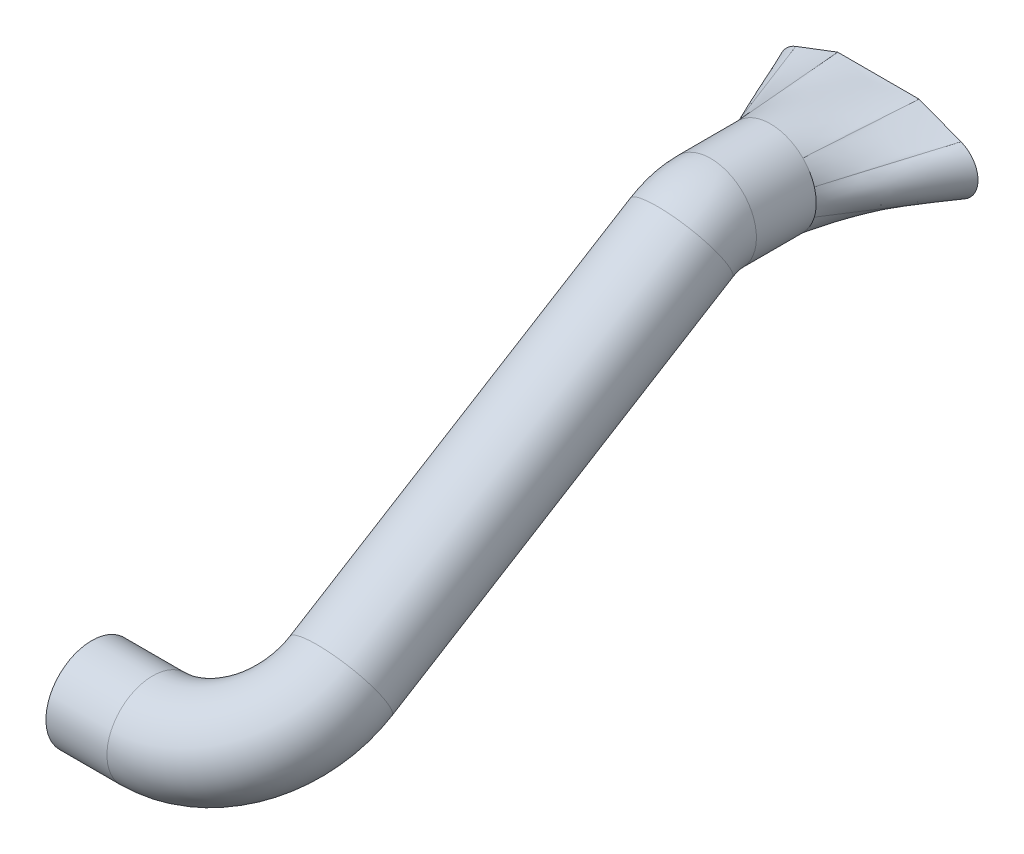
ISO-10303-21;
HEADER;
FILE_DESCRIPTION(('STEP AP214'),'2;1');
FILE_NAME('part.step','',(''),(''),'','','');
FILE_SCHEMA(('AUTOMOTIVE_DESIGN { 1 0 10303 214 1 1 1 1 }'));
ENDSEC;
DATA;
#1=APPLICATION_CONTEXT('core data for automotive mechanical design processes');
#2=APPLICATION_PROTOCOL_DEFINITION('international standard','automotive_design',2000,#1);
#3=PRODUCT_CONTEXT('',#1,'mechanical');
#4=PRODUCT('Part','Part','',(#3));
#5=PRODUCT_RELATED_PRODUCT_CATEGORY('part','',(#4));
#6=PRODUCT_DEFINITION_FORMATION('','',#4);
#7=PRODUCT_DEFINITION_CONTEXT('part definition',#1,'design');
#8=PRODUCT_DEFINITION('design','',#6,#7);
#9=PRODUCT_DEFINITION_SHAPE('','',#8);
#10=(LENGTH_UNIT() NAMED_UNIT(*) SI_UNIT(.MILLI.,.METRE.));
#11=(NAMED_UNIT(*) PLANE_ANGLE_UNIT() SI_UNIT($,.RADIAN.));
#12=(NAMED_UNIT(*) SI_UNIT($,.STERADIAN.) SOLID_ANGLE_UNIT());
#13=UNCERTAINTY_MEASURE_WITH_UNIT(LENGTH_MEASURE(1.E-05),#10,'distance_accuracy_value','');
#14=(GEOMETRIC_REPRESENTATION_CONTEXT(3) GLOBAL_UNCERTAINTY_ASSIGNED_CONTEXT((#13)) GLOBAL_UNIT_ASSIGNED_CONTEXT((#10,
#11,#12)) REPRESENTATION_CONTEXT('',''));
#15=CARTESIAN_POINT('',(0.,0.,0.));
#16=DIRECTION('',(0.,0.,1.));
#17=DIRECTION('',(1.,0.,0.));
#18=AXIS2_PLACEMENT_3D('',#15,#16,#17);
#19=CARTESIAN_POINT('',(-42.,34.,0.));
#20=DIRECTION('',(0.,0.,1.));
#21=DIRECTION('',(1.,0.,0.));
#22=AXIS2_PLACEMENT_3D('',#19,#20,#21);
#23=PLANE('',#22);
#24=CARTESIAN_POINT('',(-42.,34.,0.));
#25=DIRECTION('',(0.,0.,1.));
#26=DIRECTION('',(1.,0.,0.));
#27=AXIS2_PLACEMENT_3D('',#24,#25,#26);
#28=CIRCLE('',#27,13.);
#29=CARTESIAN_POINT('',(-46.6245425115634,46.1496340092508,0.));
#30=VERTEX_POINT('',#29);
#31=CARTESIAN_POINT('',(-46.6245425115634,21.8503659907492,0.));
#32=VERTEX_POINT('',#31);
#33=EDGE_CURVE('E143',#30,#32,#28,.T.);
#34=ORIENTED_EDGE('',*,*,#33,.F.);
#35=DIRECTION('',(-0.934587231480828,-0.355734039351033,0.));
#36=VECTOR('',#35,1.);
#37=CARTESIAN_POINT('',(-26.,54.,0.));
#38=LINE('',#37,#36);
#39=CARTESIAN_POINT('',(-26.,54.,0.));
#40=VERTEX_POINT('',#39);
#41=EDGE_CURVE('E11',#40,#30,#38,.T.);
#42=ORIENTED_EDGE('',*,*,#41,.F.);
#43=DIRECTION('',(-1.,0.,0.));
#44=VECTOR('',#43,1.);
#45=CARTESIAN_POINT('',(14.,54.,0.));
#46=LINE('',#45,#44);
#47=CARTESIAN_POINT('',(14.,54.,0.));
#48=VERTEX_POINT('',#47);
#49=EDGE_CURVE('E40',#48,#40,#46,.T.);
#50=ORIENTED_EDGE('',*,*,#49,.F.);
#51=DIRECTION('',(-0.934587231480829,0.355734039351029,0.));
#52=VECTOR('',#51,1.);
#53=CARTESIAN_POINT('',(34.6245425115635,46.1496340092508,0.));
#54=LINE('',#53,#52);
#55=CARTESIAN_POINT('',(34.6245425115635,46.1496340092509,0.));
#56=VERTEX_POINT('',#55);
#57=EDGE_CURVE('E152',#56,#48,#54,.T.);
#58=ORIENTED_EDGE('',*,*,#57,.F.);
#59=CARTESIAN_POINT('',(30.,34.,0.));
#60=DIRECTION('',(0.,0.,1.));
#61=DIRECTION('',(1.,0.,0.));
#62=AXIS2_PLACEMENT_3D('',#59,#60,#61);
#63=CIRCLE('',#62,13.0000000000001);
#64=CARTESIAN_POINT('',(34.6245425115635,21.8503659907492,0.));
#65=VERTEX_POINT('',#64);
#66=EDGE_CURVE('E149',#65,#56,#63,.T.);
#67=ORIENTED_EDGE('',*,*,#66,.F.);
#68=DIRECTION('',(0.934587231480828,0.35573403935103,0.));
#69=VECTOR('',#68,1.);
#70=CARTESIAN_POINT('',(14.,14.,0.));
#71=LINE('',#70,#69);
#72=CARTESIAN_POINT('',(14.,14.,0.));
#73=VERTEX_POINT('',#72);
#74=EDGE_CURVE('E146',#73,#65,#71,.T.);
#75=ORIENTED_EDGE('',*,*,#74,.F.);
#76=DIRECTION('',(1.,0.,0.));
#77=VECTOR('',#76,1.);
#78=CARTESIAN_POINT('',(-26.,14.,0.));
#79=LINE('',#78,#77);
#80=CARTESIAN_POINT('',(-26.,14.,0.));
#81=VERTEX_POINT('',#80);
#82=EDGE_CURVE('E142',#81,#73,#79,.T.);
#83=ORIENTED_EDGE('',*,*,#82,.F.);
#84=DIRECTION('',(0.934587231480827,-0.355734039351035,0.));
#85=VECTOR('',#84,1.);
#86=CARTESIAN_POINT('',(-46.6245425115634,21.8503659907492,0.));
#87=LINE('',#86,#85);
#88=EDGE_CURVE('E139',#32,#81,#87,.T.);
#89=ORIENTED_EDGE('',*,*,#88,.F.);
#90=EDGE_LOOP('',(#34,#42,#50,#58,#67,#75,#83,#89));
#91=FACE_BOUND('',#90,.T.);
#92=ADVANCED_FACE('F32',(#91),#23,.F.);
#93=CARTESIAN_POINT('',(-46.6245425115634,21.8503659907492,0.));
#94=CARTESIAN_POINT('',(-45.7337784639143,22.1921536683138,2.77777777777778));
#95=CARTESIAN_POINT('',(-43.952250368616,22.8757290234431,8.33333333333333));
#96=CARTESIAN_POINT('',(-41.2799582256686,23.9010920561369,16.6666666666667));
#97=CARTESIAN_POINT('',(-38.6076660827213,24.9264550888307,25.));
#98=CARTESIAN_POINT('',(-35.7126829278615,26.0372650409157,34.0277777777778));
#99=CARTESIAN_POINT('',(-33.2909181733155,26.9665002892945,41.5798611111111));
#100=CARTESIAN_POINT('',(-31.5093900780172,27.6500756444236,47.1354166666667));
#101=CARTESIAN_POINT('',(-30.8413170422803,27.9064164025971,49.21875));
#102=CARTESIAN_POINT('',(-30.590789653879,28.0025441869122,50.));
#103=CARTESIAN_POINT('',(-39.749695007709,19.2335773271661,0.));
#104=CARTESIAN_POINT('',(-39.3482825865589,19.4363849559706,2.21586738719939));
#105=CARTESIAN_POINT('',(-38.5430084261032,19.8432376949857,6.66112282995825));
#106=CARTESIAN_POINT('',(-37.0015477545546,20.6938765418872,14.5840386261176));
#107=CARTESIAN_POINT('',(-35.315250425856,21.5865639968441,22.9753008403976));
#108=CARTESIAN_POINT('',(-33.546037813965,22.7058639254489,32.2383831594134));
#109=CARTESIAN_POINT('',(-31.7453902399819,23.5628470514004,40.2747419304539));
#110=CARTESIAN_POINT('',(-30.2747850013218,24.1325842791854,46.6256772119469));
#111=CARTESIAN_POINT('',(-29.7233448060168,24.3346401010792,49.0795290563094));
#112=CARTESIAN_POINT('',(-29.5164925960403,24.4104338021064,50.));
#113=CARTESIAN_POINT('',(-32.8748475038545,16.616788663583,0.));
#114=CARTESIAN_POINT('',(-32.5877291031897,16.8655343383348,2.7191394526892));
#115=CARTESIAN_POINT('',(-32.0117403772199,17.3645434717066,8.17400986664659));
#116=CARTESIAN_POINT('',(-31.1387316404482,18.120876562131,16.4417924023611));
#117=CARTESIAN_POINT('',(-30.2599569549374,18.8822049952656,24.7641810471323));
#118=CARTESIAN_POINT('',(-29.3053603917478,19.7092218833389,33.8046367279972));
#119=CARTESIAN_POINT('',(-28.501571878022,20.4055858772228,41.4168728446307));
#120=CARTESIAN_POINT('',(-27.9041914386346,20.9231277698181,47.0743323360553));
#121=CARTESIAN_POINT('',(-27.6795363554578,21.1177582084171,49.2019162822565));
#122=CARTESIAN_POINT('',(-27.5952653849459,21.1907665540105,50.));
#123=CARTESIAN_POINT('',(-26.,14.,0.));
#124=CARTESIAN_POINT('',(-25.9413388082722,14.2521999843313,2.77777777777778));
#125=CARTESIAN_POINT('',(-25.8240164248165,14.7565999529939,8.33333333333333));
#126=CARTESIAN_POINT('',(-25.648032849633,15.5131999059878,16.6666666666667));
#127=CARTESIAN_POINT('',(-25.4720492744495,16.2697998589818,25.));
#128=CARTESIAN_POINT('',(-25.281400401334,17.0894498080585,34.0277777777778));
#129=CARTESIAN_POINT('',(-25.121915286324,17.7751185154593,41.5798611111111));
#130=CARTESIAN_POINT('',(-25.0045929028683,18.2795184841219,47.1354166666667));
#131=CARTESIAN_POINT('',(-24.9605970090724,18.4686684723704,49.21875));
#132=CARTESIAN_POINT('',(-24.944098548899,18.5395997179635,50.));
#133=(BOUNDED_SURFACE() B_SPLINE_SURFACE(3,3,((#93,#94,#95,#96,#97,#98,#99,#100,#101,#102),
(#103,#104,#105,#106,#107,#108,#109,#110,#111,#112),(#113,#114,#115,#116,#117,#118,#119,#120,
#121,#122),(#123,#124,#125,#126,#127,#128,#129,#130,#131,#132)),.UNSPECIFIED.,.F.,.F.,
.F.) B_SPLINE_SURFACE_WITH_KNOTS((4,4),(4,1,1,1,1,1,1,4),(0.666666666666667,1.),(0.,
0.166666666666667,0.333333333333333,0.5,0.666666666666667,0.875,0.953125,1.),
.UNSPECIFIED.) GEOMETRIC_REPRESENTATION_ITEM() RATIONAL_B_SPLINE_SURFACE(((1.,1.,1.,1.,1.,1.,1.,
1.,1.,1.),(1.,1.,0.997970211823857,0.992895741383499,0.989851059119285,0.986552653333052,
0.981723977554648,0.979916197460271,0.979702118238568,0.979702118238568),(1.,1.,
0.997970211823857,0.992895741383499,0.989851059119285,0.986552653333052,0.981723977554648,
0.979916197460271,0.979702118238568,0.979702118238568),(1.,1.,1.,1.,1.,1.,1.,1.,1.,1.))) REPRESENTATION_ITEM('') SURFACE());
#134=DIRECTION('',(0.0210268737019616,0.0904000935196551,0.995683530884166));
#135=VECTOR('',#134,1.);
#136=CARTESIAN_POINT('',(-25.4720492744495,16.2697998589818,25.));
#137=LINE('',#136,#135);
#138=CARTESIAN_POINT('',(-24.944098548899,18.5395997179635,50.));
#139=VERTEX_POINT('',#138);
#140=EDGE_CURVE('E156',#81,#139,#137,.T.);
#141=CARTESIAN_POINT('',(-24.944098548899,18.5395997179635,50.));
#142=CARTESIAN_POINT('',(-27.5952653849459,21.1907665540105,50.));
#143=CARTESIAN_POINT('',(-29.5164925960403,24.4104338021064,50.));
#144=CARTESIAN_POINT('',(-30.590789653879,28.0025441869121,50.));
#145=(BOUNDED_CURVE() B_SPLINE_CURVE(3,(#141,#142,#143,#144),.UNSPECIFIED.,.F.,
.F.) B_SPLINE_CURVE_WITH_KNOTS((4,4),(0.666666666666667,1.),
.UNSPECIFIED.) CURVE() GEOMETRIC_REPRESENTATION_ITEM() RATIONAL_B_SPLINE_CURVE((1.,
0.979702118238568,0.979702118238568,1.)) REPRESENTATION_ITEM(''));
#146=CARTESIAN_POINT('',(-30.5909142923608,28.0025069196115,50.));
#147=VERTEX_POINT('',#146);
#148=EDGE_CURVE('E131',#147,#139,#145,.F.);
#149=DIRECTION('',(0.303284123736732,0.116370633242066,0.945767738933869));
#150=VECTOR('',#149,1.);
#151=CARTESIAN_POINT('',(-38.6076660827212,24.9264550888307,25.));
#152=LINE('',#151,#150);
#153=EDGE_CURVE('E161',#32,#147,#152,.T.);
#154=ORIENTED_EDGE('',*,*,#88,.T.);
#155=ORIENTED_EDGE('',*,*,#140,.T.);
#156=ORIENTED_EDGE('',*,*,#148,.F.);
#157=ORIENTED_EDGE('',*,*,#153,.F.);
#158=EDGE_LOOP('',(#154,#155,#156,#157));
#159=FACE_BOUND('',#158,.T.);
#160=ADVANCED_FACE('F182',(#159),#133,.T.);
#161=CARTESIAN_POINT('',(-46.6245425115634,46.1496340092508,0.));
#162=CARTESIAN_POINT('',(-45.7337784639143,45.8577910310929,2.77777777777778));
#163=CARTESIAN_POINT('',(-43.952250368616,45.2741050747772,8.33333333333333));
#164=CARTESIAN_POINT('',(-41.2799582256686,44.3985761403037,16.6666666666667));
#165=CARTESIAN_POINT('',(-38.6076660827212,43.5230472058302,25.));
#166=CARTESIAN_POINT('',(-35.7126829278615,42.5745575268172,34.0277777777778));
#167=CARTESIAN_POINT('',(-33.2909181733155,41.7811094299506,41.5798611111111));
#168=CARTESIAN_POINT('',(-31.5093900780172,41.1974234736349,47.1354166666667));
#169=CARTESIAN_POINT('',(-30.8413170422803,40.9785412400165,49.21875));
#170=CARTESIAN_POINT('',(-30.590789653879,40.8964604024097,50.));
#171=CARTESIAN_POINT('',(-59.8937269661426,41.0989544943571,0.));
#172=CARTESIAN_POINT('',(-57.7301654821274,40.6963656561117,3.86768630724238));
#173=CARTESIAN_POINT('',(-53.829867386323,39.9706102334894,10.8400463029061));
#174=CARTESIAN_POINT('',(-48.9881607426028,38.8512754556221,20.0323374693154));
#175=CARTESIAN_POINT('',(-44.4559126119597,37.7700409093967,28.3973112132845));
#176=CARTESIAN_POINT('',(-39.7148223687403,36.7441283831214,36.9089941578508));
#177=CARTESIAN_POINT('',(-35.7149723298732,36.5236869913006,43.4053006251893));
#178=CARTESIAN_POINT('',(-33.1209188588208,36.5940706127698,47.7654531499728));
#179=CARTESIAN_POINT('',(-32.2007188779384,36.6423058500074,49.393233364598));
#180=CARTESIAN_POINT('',(-31.8577077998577,36.6602858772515,50.));
#181=CARTESIAN_POINT('',(-59.8937269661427,26.9010455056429,0.));
#182=CARTESIAN_POINT('',(-57.7386270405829,27.3766404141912,3.86690430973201));
#183=CARTESIAN_POINT('',(-53.8535827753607,28.2340054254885,10.8378545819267));
#184=CARTESIAN_POINT('',(-49.0120370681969,29.5231221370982,20.0329957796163));
#185=CARTESIAN_POINT('',(-44.4769066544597,30.7559469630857,28.3966763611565));
#186=CARTESIAN_POINT('',(-39.7322406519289,31.9374402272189,36.907422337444));
#187=CARTESIAN_POINT('',(-35.7243897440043,32.2730348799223,43.4030466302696));
#188=CARTESIAN_POINT('',(-33.123893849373,32.2716443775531,47.7633406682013));
#189=CARTESIAN_POINT('',(-32.2015267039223,32.2476593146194,49.392659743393));
#190=CARTESIAN_POINT('',(-31.8577077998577,32.2387187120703,50.));
#191=CARTESIAN_POINT('',(-46.6245425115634,21.8503659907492,0.));
#192=CARTESIAN_POINT('',(-45.7337784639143,22.1921536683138,2.77777777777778));
#193=CARTESIAN_POINT('',(-43.952250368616,22.8757290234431,8.33333333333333));
#194=CARTESIAN_POINT('',(-41.2799582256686,23.9010920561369,16.6666666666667));
#195=CARTESIAN_POINT('',(-38.6076660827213,24.9264550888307,25.));
#196=CARTESIAN_POINT('',(-35.7126829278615,26.0372650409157,34.0277777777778));
#197=CARTESIAN_POINT('',(-33.2909181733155,26.9665002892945,41.5798611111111));
#198=CARTESIAN_POINT('',(-31.5093900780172,27.6500756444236,47.1354166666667));
#199=CARTESIAN_POINT('',(-30.8413170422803,27.9064164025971,49.21875));
#200=CARTESIAN_POINT('',(-30.590789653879,28.0025441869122,50.));
#201=(BOUNDED_SURFACE() B_SPLINE_SURFACE(3,3,((#161,#162,#163,#164,#165,#166,#167,#168,#169,
#170),(#171,#172,#173,#174,#175,#176,#177,#178,#179,#180),(#181,#182,#183,#184,#185,#186,#187,
#188,#189,#190),(#191,#192,#193,#194,#195,#196,#197,#198,#199,#200)),.UNSPECIFIED.,.F.,.F.,
.F.) B_SPLINE_SURFACE_WITH_KNOTS((4,4),(4,1,1,1,1,1,1,4),(0.333333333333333,0.666666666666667),
(0.,0.166666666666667,0.333333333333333,0.5,0.666666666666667,0.875,0.953125,1.),
.UNSPECIFIED.) GEOMETRIC_REPRESENTATION_ITEM() RATIONAL_B_SPLINE_SURFACE(((1.,1.,1.,1.,1.,1.,1.,
1.,1.,1.),(0.570489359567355,0.570489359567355,0.610645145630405,0.711034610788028,
0.771268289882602,0.836521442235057,0.932048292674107,0.967812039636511,0.972047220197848,
0.972047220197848),(0.570489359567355,0.570489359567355,0.610645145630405,0.711034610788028,
0.771268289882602,0.836521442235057,0.932048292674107,0.967812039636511,0.972047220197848,
0.972047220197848),(1.,1.,1.,1.,1.,1.,1.,1.,1.,1.))) REPRESENTATION_ITEM('') SURFACE());
#202=CARTESIAN_POINT('',(-30.590789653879,28.0025441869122,50.));
#203=CARTESIAN_POINT('',(-31.8577077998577,32.2387187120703,50.));
#204=CARTESIAN_POINT('',(-31.8577077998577,36.6602858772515,50.));
#205=CARTESIAN_POINT('',(-30.590789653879,40.8964604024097,50.));
#206=(BOUNDED_CURVE() B_SPLINE_CURVE(3,(#202,#203,#204,#205),.UNSPECIFIED.,.F.,
.F.) B_SPLINE_CURVE_WITH_KNOTS((4,4),(0.333333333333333,0.666666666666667),
.UNSPECIFIED.) CURVE() GEOMETRIC_REPRESENTATION_ITEM() RATIONAL_B_SPLINE_CURVE((1.,
0.972047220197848,0.972047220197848,1.)) REPRESENTATION_ITEM(''));
#207=CARTESIAN_POINT('',(-30.5909153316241,40.8964979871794,50.));
#208=VERTEX_POINT('',#207);
#209=EDGE_CURVE('E114',#208,#147,#206,.F.);
#210=DIRECTION('',(0.30384197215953,-0.09954841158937,0.947507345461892));
#211=VECTOR('',#210,1.);
#212=CARTESIAN_POINT('',(-38.6076660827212,43.5230472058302,25.));
#213=LINE('',#212,#211);
#214=EDGE_CURVE('E48',#30,#208,#213,.T.);
#215=ORIENTED_EDGE('',*,*,#33,.T.);
#216=ORIENTED_EDGE('',*,*,#153,.T.);
#217=ORIENTED_EDGE('',*,*,#209,.F.);
#218=ORIENTED_EDGE('',*,*,#214,.F.);
#219=EDGE_LOOP('',(#215,#216,#217,#218));
#220=FACE_BOUND('',#219,.T.);
#221=ADVANCED_FACE('F171',(#220),#201,.T.);
#222=CARTESIAN_POINT('',(-26.,54.,0.));
#223=CARTESIAN_POINT('',(-25.9413388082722,53.7977447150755,2.77777777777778));
#224=CARTESIAN_POINT('',(-25.8240164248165,53.3932341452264,8.33333333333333));
#225=CARTESIAN_POINT('',(-25.648032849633,52.7864682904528,16.6666666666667));
#226=CARTESIAN_POINT('',(-25.4720492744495,52.1797024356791,25.));
#227=CARTESIAN_POINT('',(-25.281400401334,51.5223727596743,34.0277777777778));
#228=CARTESIAN_POINT('',(-25.121915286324,50.9724912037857,41.5798611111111));
#229=CARTESIAN_POINT('',(-25.0045929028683,50.5679806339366,47.1354166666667));
#230=CARTESIAN_POINT('',(-24.9605970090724,50.4162891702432,49.21875));
#231=CARTESIAN_POINT('',(-24.944098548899,50.3594048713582,50.));
#232=CARTESIAN_POINT('',(-32.8748475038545,51.383211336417,0.));
#233=CARTESIAN_POINT('',(-32.5877291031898,51.1833560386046,2.7191394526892));
#234=CARTESIAN_POINT('',(-32.0117403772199,50.782425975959,8.1740098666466));
#235=CARTESIAN_POINT('',(-31.1387316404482,50.174748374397,16.4417924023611));
#236=CARTESIAN_POINT('',(-30.2599569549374,49.5630572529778,24.7641810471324));
#237=CARTESIAN_POINT('',(-29.3053603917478,48.8985885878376,33.8046367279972));
#238=CARTESIAN_POINT('',(-28.501571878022,48.3390932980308,41.4168728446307));
#239=CARTESIAN_POINT('',(-27.9041914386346,47.9232730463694,47.0743323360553));
#240=CARTESIAN_POINT('',(-27.6795363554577,47.7668967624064,49.2019162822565));
#241=CARTESIAN_POINT('',(-27.5952653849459,47.7082380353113,50.));
#242=CARTESIAN_POINT('',(-39.749695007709,48.7664226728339,0.));
#243=CARTESIAN_POINT('',(-39.3447797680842,48.6055266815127,2.21379415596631));
#244=CARTESIAN_POINT('',(-38.532478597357,48.2827529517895,6.65489048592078));
#245=CARTESIAN_POINT('',(-36.9901225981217,47.5786385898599,14.5719440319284));
#246=CARTESIAN_POINT('',(-35.3045738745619,46.83997877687,22.9612422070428));
#247=CARTESIAN_POINT('',(-33.5385388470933,45.8895900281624,32.2229512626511));
#248=CARTESIAN_POINT('',(-31.7411344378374,45.1750742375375,40.2649876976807));
#249=CARTESIAN_POINT('',(-30.2734462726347,44.711612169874,46.6231327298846));
#250=CARTESIAN_POINT('',(-29.7229796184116,44.5494135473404,49.078834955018));
#251=CARTESIAN_POINT('',(-29.5164925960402,44.4885707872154,50.));
#252=CARTESIAN_POINT('',(-46.6245425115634,46.1496340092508,0.));
#253=CARTESIAN_POINT('',(-45.7337784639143,45.8577910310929,2.77777777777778));
#254=CARTESIAN_POINT('',(-43.952250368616,45.2741050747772,8.33333333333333));
#255=CARTESIAN_POINT('',(-41.2799582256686,44.3985761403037,16.6666666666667));
#256=CARTESIAN_POINT('',(-38.6076660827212,43.5230472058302,25.));
#257=CARTESIAN_POINT('',(-35.7126829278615,42.5745575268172,34.0277777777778));
#258=CARTESIAN_POINT('',(-33.2909181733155,41.7811094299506,41.5798611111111));
#259=CARTESIAN_POINT('',(-31.5093900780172,41.1974234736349,47.1354166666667));
#260=CARTESIAN_POINT('',(-30.8413170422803,40.9785412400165,49.21875));
#261=CARTESIAN_POINT('',(-30.590789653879,40.8964604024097,50.));
#262=(BOUNDED_SURFACE() B_SPLINE_SURFACE(3,3,((#222,#223,#224,#225,#226,#227,#228,#229,#230,
#231),(#232,#233,#234,#235,#236,#237,#238,#239,#240,#241),(#242,#243,#244,#245,#246,#247,#248,
#249,#250,#251),(#252,#253,#254,#255,#256,#257,#258,#259,#260,#261)),.UNSPECIFIED.,.F.,.F.,
.F.) B_SPLINE_SURFACE_WITH_KNOTS((4,4),(4,1,1,1,1,1,1,4),(0.,0.333333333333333),(0.,
0.166666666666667,0.333333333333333,0.5,0.666666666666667,0.875,0.953125,1.),
.UNSPECIFIED.) GEOMETRIC_REPRESENTATION_ITEM() RATIONAL_B_SPLINE_SURFACE(((1.,1.,1.,1.,1.,1.,1.,
1.,1.,1.),(1.,1.,0.997970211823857,0.992895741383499,0.989851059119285,0.986552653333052,
0.981723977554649,0.979916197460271,0.979702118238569,0.979702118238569),(1.,1.,
0.997970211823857,0.992895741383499,0.989851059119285,0.986552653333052,0.981723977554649,
0.979916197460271,0.979702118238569,0.979702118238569),(1.,1.,1.,1.,1.,1.,1.,1.,1.,1.))) REPRESENTATION_ITEM('') SURFACE());
#263=CARTESIAN_POINT('',(-9.03419597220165,34.4495022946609,50.));
#264=DIRECTION('',(0.,0.,-1.));
#265=DIRECTION('',(-1.,0.,0.));
#266=AXIS2_PLACEMENT_3D('',#263,#264,#265);
#267=CIRCLE('',#266,22.5);
#268=CARTESIAN_POINT('',(-24.944098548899,50.3594048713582,50.));
#269=VERTEX_POINT('',#268);
#270=EDGE_CURVE('E109',#269,#208,#267,.F.);
#271=DIRECTION('',(0.0210576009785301,-0.072603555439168,0.997138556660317));
#272=VECTOR('',#271,1.);
#273=CARTESIAN_POINT('',(-25.4720492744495,52.1797024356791,25.));
#274=LINE('',#273,#272);
#275=EDGE_CURVE('E97',#40,#269,#274,.T.);
#276=ORIENTED_EDGE('',*,*,#41,.T.);
#277=ORIENTED_EDGE('',*,*,#214,.T.);
#278=ORIENTED_EDGE('',*,*,#270,.F.);
#279=ORIENTED_EDGE('',*,*,#275,.F.);
#280=EDGE_LOOP('',(#276,#277,#278,#279));
#281=FACE_BOUND('',#280,.T.);
#282=ADVANCED_FACE('F110',(#281),#262,.T.);
#283=CARTESIAN_POINT('',(-26.,14.,0.));
#284=CARTESIAN_POINT('',(-24.944098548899,18.5395997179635,50.));
#285=CARTESIAN_POINT('',(-12.6666666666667,14.,0.));
#286=CARTESIAN_POINT('',(-15.6242933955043,9.21979456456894,50.));
#287=CARTESIAN_POINT('',(0.666666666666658,14.,0.));
#288=CARTESIAN_POINT('',(-2.44409854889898,9.21979456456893,50.));
#289=CARTESIAN_POINT('',(14.,14.,0.));
#290=CARTESIAN_POINT('',(6.87570660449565,18.5395997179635,50.));
#291=(BOUNDED_SURFACE() B_SPLINE_SURFACE(3,1,((#283,#284),(#285,#286),(#287,#288),(#289,#290)),
.UNSPECIFIED.,.F.,.F.,.F.) B_SPLINE_SURFACE_WITH_KNOTS((4,4),(2,2),(0.,1.),(0.,1.),
.UNSPECIFIED.) GEOMETRIC_REPRESENTATION_ITEM() RATIONAL_B_SPLINE_SURFACE(((1.,1.),(1.,
0.804737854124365),(1.,0.804737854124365),(1.,1.))) REPRESENTATION_ITEM('') SURFACE());
#292=DIRECTION('',(-0.140494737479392,0.0895232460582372,0.986025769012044));
#293=VECTOR('',#292,1.);
#294=CARTESIAN_POINT('',(10.4378533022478,16.2697998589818,25.));
#295=LINE('',#294,#293);
#296=CARTESIAN_POINT('',(6.87570660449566,18.5395997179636,50.));
#297=VERTEX_POINT('',#296);
#298=EDGE_CURVE('E106',#73,#297,#295,.T.);
#299=CARTESIAN_POINT('',(6.87570660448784,18.5395997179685,50.0000000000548));
#300=CARTESIAN_POINT('',(6.63920978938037,18.3030952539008,50.0000000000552));
#301=CARTESIAN_POINT('',(6.39743206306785,18.0718715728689,50.0000000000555));
#302=CARTESIAN_POINT('',(5.89946348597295,17.6164517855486,50.0000000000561));
#303=CARTESIAN_POINT('',(5.64309375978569,17.3924512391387,50.0000000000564));
#304=CARTESIAN_POINT('',(5.11608629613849,16.9526660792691,50.0000000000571));
#305=CARTESIAN_POINT('',(4.84528168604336,16.7370814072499,50.0000000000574));
#306=CARTESIAN_POINT('',(4.28967064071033,16.3153321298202,50.000000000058));
#307=CARTESIAN_POINT('',(4.00471075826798,16.1093696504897,50.0000000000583));
#308=CARTESIAN_POINT('',(3.42117603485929,15.7080791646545,50.0000000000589));
#309=CARTESIAN_POINT('',(3.12246226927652,15.5129531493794,50.0000000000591));
#310=CARTESIAN_POINT('',(2.51193413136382,15.13454364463,50.0000000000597));
#311=CARTESIAN_POINT('',(2.19999622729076,14.951459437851,50.0000000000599));
#312=CARTESIAN_POINT('',(1.56366405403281,14.5983200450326,50.0000000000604));
#313=CARTESIAN_POINT('',(1.23916220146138,14.4284586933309,50.0000000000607));
#314=CARTESIAN_POINT('',(0.578477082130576,14.1029130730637,50.0000000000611));
#315=CARTESIAN_POINT('',(0.242202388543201,13.9474143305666,50.0000000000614));
#316=CARTESIAN_POINT('',(-0.441124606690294,13.6516863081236,50.0000000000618));
#317=CARTESIAN_POINT('',(-0.788252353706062,13.5116313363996,50.000000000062));
#318=CARTESIAN_POINT('',(-1.49225725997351,13.2478100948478,50.0000000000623));
#319=CARTESIAN_POINT('',(-1.84919446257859,13.1242040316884,50.0000000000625));
#320=CARTESIAN_POINT('',(-2.57167292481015,12.8942095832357,50.0000000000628));
#321=CARTESIAN_POINT('',(-2.93725981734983,12.7879645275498,50.000000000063));
#322=CARTESIAN_POINT('',(-3.67578511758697,12.5935144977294,50.0000000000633));
#323=CARTESIAN_POINT('',(-4.04875614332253,12.5054333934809,50.0000000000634));
#324=CARTESIAN_POINT('',(-4.80070259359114,12.348012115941,50.0000000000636));
#325=CARTESIAN_POINT('',(-5.17969939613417,12.2787740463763,50.0000000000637));
#326=CARTESIAN_POINT('',(-5.94227074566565,12.159604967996,50.0000000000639));
#327=CARTESIAN_POINT('',(-6.32585754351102,12.1097523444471,50.000000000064));
#328=CARTESIAN_POINT('',(-7.09611983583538,12.0297746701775,50.0000000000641));
#329=CARTESIAN_POINT('',(-7.48280084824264,11.9997027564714,50.0000000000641));
#330=CARTESIAN_POINT('',(-8.25771897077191,11.9595531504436,50.0000000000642));
#331=CARTESIAN_POINT('',(-8.64595747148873,11.9495022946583,50.0000000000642));
#332=CARTESIAN_POINT('',(-9.42243447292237,11.9495022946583,50.0000000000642));
#333=CARTESIAN_POINT('',(-9.81067297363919,11.9595531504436,50.0000000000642));
#334=CARTESIAN_POINT('',(-10.5855910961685,11.9997027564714,50.0000000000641));
#335=CARTESIAN_POINT('',(-10.9722721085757,12.0297746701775,50.0000000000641));
#336=CARTESIAN_POINT('',(-11.7425344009,12.1097523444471,50.000000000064));
#337=CARTESIAN_POINT('',(-12.1261211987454,12.159604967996,50.0000000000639));
#338=CARTESIAN_POINT('',(-12.8886925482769,12.2787740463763,50.0000000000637));
#339=CARTESIAN_POINT('',(-13.2676893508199,12.348012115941,50.0000000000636));
#340=CARTESIAN_POINT('',(-14.0196358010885,12.5054333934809,50.0000000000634));
#341=CARTESIAN_POINT('',(-14.392606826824,12.5935144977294,50.0000000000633));
#342=CARTESIAN_POINT('',(-15.1311321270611,12.7879645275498,50.000000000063));
#343=CARTESIAN_POINT('',(-15.4967190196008,12.8942095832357,50.0000000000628));
#344=CARTESIAN_POINT('',(-16.2191974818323,13.1242040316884,50.0000000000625));
#345=CARTESIAN_POINT('',(-16.5761346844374,13.2478100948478,50.0000000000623));
#346=CARTESIAN_POINT('',(-17.2801395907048,13.5116313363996,50.000000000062));
#347=CARTESIAN_POINT('',(-17.6272673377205,13.6516863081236,50.0000000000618));
#348=CARTESIAN_POINT('',(-18.310594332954,13.9474143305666,50.0000000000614));
#349=CARTESIAN_POINT('',(-18.6468690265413,14.1029130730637,50.0000000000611));
#350=CARTESIAN_POINT('',(-19.307554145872,14.4284586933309,50.0000000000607));
#351=CARTESIAN_POINT('',(-19.6320559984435,14.5983200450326,50.0000000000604));
#352=CARTESIAN_POINT('',(-20.2683881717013,14.951459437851,50.0000000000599));
#353=CARTESIAN_POINT('',(-20.5803260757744,15.13454364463,50.0000000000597));
#354=CARTESIAN_POINT('',(-21.190854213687,15.5129531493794,50.0000000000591));
#355=CARTESIAN_POINT('',(-21.4895679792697,15.7080791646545,50.0000000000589));
#356=CARTESIAN_POINT('',(-22.0731027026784,16.1093696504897,50.0000000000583));
#357=CARTESIAN_POINT('',(-22.3580625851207,16.3153321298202,50.000000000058));
#358=CARTESIAN_POINT('',(-22.9136736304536,16.7370814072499,50.0000000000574));
#359=CARTESIAN_POINT('',(-23.1844782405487,16.9526660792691,50.0000000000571));
#360=CARTESIAN_POINT('',(-23.7114857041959,17.3924512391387,50.0000000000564));
#361=CARTESIAN_POINT('',(-23.9678554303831,17.6164517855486,50.0000000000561));
#362=CARTESIAN_POINT('',(-24.4658240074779,18.0718715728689,50.0000000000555));
#363=CARTESIAN_POINT('',(-24.7076017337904,18.3030952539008,50.0000000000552));
#364=CARTESIAN_POINT('',(-24.9440985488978,18.5395997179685,50.0000000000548));
#365=B_SPLINE_CURVE_WITH_KNOTS('',3,(#299,#300,#301,#302,#303,#304,#305,#306,#307,#308,#309,
#310,#311,#312,#313,#314,#315,#316,#317,#318,#319,#320,#321,#322,#323,#324,#325,#326,#327,#328,
#329,#330,#331,#332,#333,#334,#335,#336,#337,#338,#339,#340,#341,#342,#343,#344,#345,#346,#347,
#348,#349,#350,#351,#352,#353,#354,#355,#356,#357,#358,#359,#360,#361,#362,#363,#364),
.UNSPECIFIED.,.F.,.F.,(4,2,2,2,2,2,2,2,2,2,2,2,2,2,2,2,2,2,2,2,2,2,2,2,2,2,2,2,2,2,2,2,4),(0.,
1.00330489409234,2.02428453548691,3.06233169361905,4.11674611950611,5.18673353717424,
6.27140572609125,7.36978179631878,8.48079073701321,9.60327529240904,10.7359971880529,
11.8776436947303,13.0268354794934,14.1821356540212,15.342059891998,16.5050874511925,
17.6696729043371,18.8342583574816,19.9972859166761,21.1572101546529,22.3125103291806,
23.4617021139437,24.603348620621,25.7360705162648,26.8585550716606,27.969564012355,
29.0679400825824,30.1526122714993,31.2225996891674,32.2770141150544,33.3150612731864,
34.3360409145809,35.3393458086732),.UNSPECIFIED.);
#366=EDGE_CURVE('E134',#139,#297,#365,.F.);
#367=ORIENTED_EDGE('',*,*,#82,.T.);
#368=ORIENTED_EDGE('',*,*,#298,.T.);
#369=ORIENTED_EDGE('',*,*,#366,.F.);
#370=ORIENTED_EDGE('',*,*,#140,.F.);
#371=EDGE_LOOP('',(#367,#368,#369,#370));
#372=FACE_BOUND('',#371,.T.);
#373=ADVANCED_FACE('F224',(#372),#291,.T.);
#374=CARTESIAN_POINT('',(14.,54.,0.));
#375=CARTESIAN_POINT('',(6.87570660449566,50.3594048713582,50.));
#376=CARTESIAN_POINT('',(0.666666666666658,54.,0.));
#377=CARTESIAN_POINT('',(-2.44409854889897,59.6792100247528,50.));
#378=CARTESIAN_POINT('',(-12.6666666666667,54.,0.));
#379=CARTESIAN_POINT('',(-15.6242933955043,59.6792100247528,50.));
#380=CARTESIAN_POINT('',(-26.,54.,0.));
#381=CARTESIAN_POINT('',(-24.944098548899,50.3594048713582,50.));
#382=(BOUNDED_SURFACE() B_SPLINE_SURFACE(3,1,((#374,#375),(#376,#377),(#378,#379),(#380,#381)),
.UNSPECIFIED.,.F.,.F.,.F.) B_SPLINE_SURFACE_WITH_KNOTS((4,4),(2,2),(0.,1.),(0.,1.),
.UNSPECIFIED.) GEOMETRIC_REPRESENTATION_ITEM() RATIONAL_B_SPLINE_SURFACE(((1.,1.),(1.,
0.804737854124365),(1.,0.804737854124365),(1.,1.))) REPRESENTATION_ITEM('') SURFACE());
#383=CARTESIAN_POINT('',(-24.944098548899,50.3594048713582,50.0000000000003));
#384=CARTESIAN_POINT('',(-24.7076017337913,50.5959093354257,50.0000000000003));
#385=CARTESIAN_POINT('',(-24.4658240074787,50.8271330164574,50.0000000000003));
#386=CARTESIAN_POINT('',(-23.9678554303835,51.2825528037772,50.0000000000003));
#387=CARTESIAN_POINT('',(-23.7114857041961,51.5065533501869,50.0000000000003));
#388=CARTESIAN_POINT('',(-23.1844782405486,51.946338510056,50.0000000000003));
#389=CARTESIAN_POINT('',(-22.9136736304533,52.161923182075,50.0000000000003));
#390=CARTESIAN_POINT('',(-22.3580625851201,52.5836724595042,50.0000000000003));
#391=CARTESIAN_POINT('',(-22.0731027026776,52.7896349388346,50.0000000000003));
#392=CARTESIAN_POINT('',(-21.4895679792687,53.1909254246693,50.0000000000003));
#393=CARTESIAN_POINT('',(-21.1908542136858,53.3860514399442,50.0000000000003));
#394=CARTESIAN_POINT('',(-20.5803260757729,53.7644609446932,50.0000000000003));
#395=CARTESIAN_POINT('',(-20.2683881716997,53.9475451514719,50.0000000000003));
#396=CARTESIAN_POINT('',(-19.6320559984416,54.3006845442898,50.0000000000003));
#397=CARTESIAN_POINT('',(-19.3075541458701,54.4705458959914,50.0000000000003));
#398=CARTESIAN_POINT('',(-18.6468690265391,54.7960915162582,50.0000000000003));
#399=CARTESIAN_POINT('',(-18.3105943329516,54.9515902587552,50.0000000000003));
#400=CARTESIAN_POINT('',(-17.627267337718,55.2473182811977,50.0000000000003));
#401=CARTESIAN_POINT('',(-17.2801395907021,55.3873732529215,50.0000000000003));
#402=CARTESIAN_POINT('',(-16.5761346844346,55.6511944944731,50.0000000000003));
#403=CARTESIAN_POINT('',(-16.2191974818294,55.7748005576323,50.0000000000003));
#404=CARTESIAN_POINT('',(-15.4967190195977,56.0047950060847,50.0000000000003));
#405=CARTESIAN_POINT('',(-15.131132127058,56.1110400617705,50.0000000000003));
#406=CARTESIAN_POINT('',(-14.3926068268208,56.3054900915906,50.0000000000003));
#407=CARTESIAN_POINT('',(-14.0196358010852,56.393571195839,50.0000000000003));
#408=CARTESIAN_POINT('',(-13.2676893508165,56.5509924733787,50.0000000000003));
#409=CARTESIAN_POINT('',(-12.8886925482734,56.6202305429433,50.0000000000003));
#410=CARTESIAN_POINT('',(-12.1261211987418,56.7393996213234,50.0000000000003));
#411=CARTESIAN_POINT('',(-11.7425344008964,56.7892522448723,50.0000000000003));
#412=CARTESIAN_POINT('',(-10.972272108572,56.8692299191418,50.0000000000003));
#413=CARTESIAN_POINT('',(-10.5855910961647,56.8993018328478,50.0000000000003));
#414=CARTESIAN_POINT('',(-9.81067297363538,56.9394514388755,50.0000000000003));
#415=CARTESIAN_POINT('',(-9.42243447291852,56.9495022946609,50.0000000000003));
#416=CARTESIAN_POINT('',(-8.64595747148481,56.9495022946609,50.0000000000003));
#417=CARTESIAN_POINT('',(-8.25771897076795,56.9394514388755,50.0000000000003));
#418=CARTESIAN_POINT('',(-7.48280084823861,56.8993018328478,50.0000000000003));
#419=CARTESIAN_POINT('',(-7.09611983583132,56.8692299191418,50.0000000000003));
#420=CARTESIAN_POINT('',(-6.32585754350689,56.7892522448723,50.0000000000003));
#421=CARTESIAN_POINT('',(-5.94227074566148,56.7393996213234,50.0000000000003));
#422=CARTESIAN_POINT('',(-5.17969939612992,56.6202305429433,50.0000000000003));
#423=CARTESIAN_POINT('',(-4.80070259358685,56.5509924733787,50.0000000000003));
#424=CARTESIAN_POINT('',(-4.04875614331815,56.393571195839,50.0000000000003));
#425=CARTESIAN_POINT('',(-3.67578511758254,56.3054900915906,50.0000000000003));
#426=CARTESIAN_POINT('',(-2.93725981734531,56.1110400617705,50.0000000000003));
#427=CARTESIAN_POINT('',(-2.57167292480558,56.0047950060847,50.0000000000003));
#428=CARTESIAN_POINT('',(-1.8491944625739,55.7748005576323,50.0000000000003));
#429=CARTESIAN_POINT('',(-1.49225725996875,55.6511944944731,50.0000000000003));
#430=CARTESIAN_POINT('',(-0.788252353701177,55.3873732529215,50.0000000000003));
#431=CARTESIAN_POINT('',(-0.441124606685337,55.2473182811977,50.0000000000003));
#432=CARTESIAN_POINT('',(0.242202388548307,54.9515902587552,50.0000000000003));
#433=CARTESIAN_POINT('',(0.578477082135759,54.7960915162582,50.0000000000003));
#434=CARTESIAN_POINT('',(1.23916220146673,54.4705458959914,50.0000000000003));
#435=CARTESIAN_POINT('',(1.56366405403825,54.3006845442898,50.0000000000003));
#436=CARTESIAN_POINT('',(2.19999622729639,53.9475451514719,50.0000000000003));
#437=CARTESIAN_POINT('',(2.51193413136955,53.7644609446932,50.0000000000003));
#438=CARTESIAN_POINT('',(3.12246226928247,53.3860514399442,50.0000000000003));
#439=CARTESIAN_POINT('',(3.42117603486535,53.1909254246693,50.0000000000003));
#440=CARTESIAN_POINT('',(4.00471075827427,52.7896349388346,50.0000000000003));
#441=CARTESIAN_POINT('',(4.28967064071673,52.5836724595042,50.0000000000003));
#442=CARTESIAN_POINT('',(4.84528168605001,52.1619231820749,50.0000000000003));
#443=CARTESIAN_POINT('',(5.11608629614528,51.946338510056,50.0000000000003));
#444=CARTESIAN_POINT('',(5.64309375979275,51.5065533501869,50.0000000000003));
#445=CARTESIAN_POINT('',(5.89946348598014,51.2825528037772,50.0000000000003));
#446=CARTESIAN_POINT('',(6.39743206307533,50.8271330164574,50.0000000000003));
#447=CARTESIAN_POINT('',(6.639209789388,50.5959093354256,50.0000000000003));
#448=CARTESIAN_POINT('',(6.87570660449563,50.3594048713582,50.0000000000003));
#449=B_SPLINE_CURVE_WITH_KNOTS('',3,(#383,#384,#385,#386,#387,#388,#389,#390,#391,#392,#393,
#394,#395,#396,#397,#398,#399,#400,#401,#402,#403,#404,#405,#406,#407,#408,#409,#410,#411,#412,
#413,#414,#415,#416,#417,#418,#419,#420,#421,#422,#423,#424,#425,#426,#427,#428,#429,#430,#431,
#432,#433,#434,#435,#436,#437,#438,#439,#440,#441,#442,#443,#444,#445,#446,#447,#448),
.UNSPECIFIED.,.F.,.F.,(4,2,2,2,2,2,2,2,2,2,2,2,2,2,2,2,2,2,2,2,2,2,2,2,2,2,2,2,2,2,2,2,4),(0.,
1.00330489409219,2.02428453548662,3.06233169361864,4.11674611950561,5.18673353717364,
6.2714057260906,7.36978179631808,8.4807907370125,9.60327529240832,10.7359971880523,
11.8776436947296,13.0268354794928,14.1821356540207,15.3420598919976,16.5050874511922,
17.6696729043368,18.8342583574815,19.9972859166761,21.157210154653,22.3125103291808,
23.461702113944,24.6033486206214,25.7360705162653,26.8585550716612,27.9695640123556,
29.0679400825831,30.1526122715,31.2225996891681,32.277014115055,33.315061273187,
34.3360409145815,35.3393458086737),.UNSPECIFIED.);
#450=CARTESIAN_POINT('',(6.87570660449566,50.3594048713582,50.));
#451=VERTEX_POINT('',#450);
#452=EDGE_CURVE('E102',#451,#269,#449,.F.);
#453=DIRECTION('',(0.140696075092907,0.0718972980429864,-0.987438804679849));
#454=VECTOR('',#453,1.);
#455=CARTESIAN_POINT('',(10.4378533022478,52.1797024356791,25.));
#456=LINE('',#455,#454);
#457=EDGE_CURVE('E266',#451,#48,#456,.T.);
#458=ORIENTED_EDGE('',*,*,#49,.T.);
#459=ORIENTED_EDGE('',*,*,#275,.T.);
#460=ORIENTED_EDGE('',*,*,#452,.F.);
#461=ORIENTED_EDGE('',*,*,#457,.T.);
#462=EDGE_LOOP('',(#458,#459,#460,#461));
#463=FACE_BOUND('',#462,.T.);
#464=ADVANCED_FACE('F99',(#463),#382,.T.);
#465=CARTESIAN_POINT('',(34.6245425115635,46.1496340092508,0.));
#466=CARTESIAN_POINT('',(33.3966455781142,45.857791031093,2.77777777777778));
#467=CARTESIAN_POINT('',(30.9408517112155,45.2741050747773,8.33333333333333));
#468=CARTESIAN_POINT('',(27.2571609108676,44.3985761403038,16.6666666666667));
#469=CARTESIAN_POINT('',(23.5734701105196,43.5230472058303,25.));
#470=CARTESIAN_POINT('',(19.5828050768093,42.5745575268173,34.0277777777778));
#471=CARTESIAN_POINT('',(15.8991142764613,41.6990285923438,42.3611111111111));
#472=CARTESIAN_POINT('',(13.4433204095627,41.115342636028,47.9166666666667));
#473=CARTESIAN_POINT('',(12.5223977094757,40.8964604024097,50.));
#474=CARTESIAN_POINT('',(27.749695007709,48.7664226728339,0.));
#475=CARTESIAN_POINT('',(27.0402950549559,48.6283935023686,2.19187860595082));
#476=CARTESIAN_POINT('',(25.6171665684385,48.3514929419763,6.58901011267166));
#477=CARTESIAN_POINT('',(23.1202955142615,47.6775700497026,14.4682291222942));
#478=CARTESIAN_POINT('',(20.4472416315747,46.9357901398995,22.877379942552));
#479=CARTESIAN_POINT('',(17.6015476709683,45.9558408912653,32.1813067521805));
#480=CARTESIAN_POINT('',(14.5489015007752,45.1374917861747,41.0518648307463));
#481=CARTESIAN_POINT('',(12.2950876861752,44.6658242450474,47.5558074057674));
#482=CARTESIAN_POINT('',(11.4481006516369,44.4885707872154,50.));
#483=CARTESIAN_POINT('',(20.8748475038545,51.3832113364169,0.));
#484=CARTESIAN_POINT('',(20.2577130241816,51.1833560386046,2.7191394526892));
#485=CARTESIAN_POINT('',(19.0196784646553,50.782425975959,8.1740098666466));
#486=CARTESIAN_POINT('',(17.1432268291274,50.1747483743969,16.4417924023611));
#487=CARTESIAN_POINT('',(15.2543818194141,49.5630572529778,24.7641810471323));
#488=CARTESIAN_POINT('',(13.2025646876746,48.8985885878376,33.8046367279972));
#489=CARTESIAN_POINT('',(11.295200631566,48.2809001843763,42.2086216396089));
#490=CARTESIAN_POINT('',(10.0098938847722,47.8646613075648,47.8717767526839));
#491=CARTESIAN_POINT('',(9.52687344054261,47.7082380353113,50.));
#492=CARTESIAN_POINT('',(14.,54.,0.));
#493=CARTESIAN_POINT('',(13.604205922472,53.7977447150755,2.77777777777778));
#494=CARTESIAN_POINT('',(12.8126177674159,53.3932341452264,8.33333333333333));
#495=CARTESIAN_POINT('',(11.6252355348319,52.7864682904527,16.6666666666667));
#496=CARTESIAN_POINT('',(10.4378533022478,52.1797024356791,25.));
#497=CARTESIAN_POINT('',(9.15152255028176,51.5223727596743,34.0277777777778));
#498=CARTESIAN_POINT('',(7.96414031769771,50.9156069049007,42.3611111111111));
#499=CARTESIAN_POINT('',(7.17255216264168,50.5110963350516,47.9166666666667));
#500=CARTESIAN_POINT('',(6.87570660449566,50.3594048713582,50.));
#501=(BOUNDED_SURFACE() B_SPLINE_SURFACE(3,3,((#465,#466,#467,#468,#469,#470,#471,#472,#473),
(#474,#475,#476,#477,#478,#479,#480,#481,#482),(#483,#484,#485,#486,#487,#488,#489,#490,#491),
(#492,#493,#494,#495,#496,#497,#498,#499,#500)),.UNSPECIFIED.,.F.,.F.,
.F.) B_SPLINE_SURFACE_WITH_KNOTS((4,4),(4,1,1,1,1,1,4),(0.666666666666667,1.),(0.,
0.166666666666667,0.333333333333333,0.5,0.666666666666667,0.875,1.),
.UNSPECIFIED.) GEOMETRIC_REPRESENTATION_ITEM() RATIONAL_B_SPLINE_SURFACE(((1.,1.,1.,1.,1.,1.,1.,
1.,1.),(1.,1.,0.997970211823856,0.992895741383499,0.989851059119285,0.986552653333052,
0.981224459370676,0.979702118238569,0.979702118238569),(1.,1.,0.997970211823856,
0.992895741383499,0.989851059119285,0.986552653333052,0.981224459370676,0.979702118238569,
0.979702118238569),(1.,1.,1.,1.,1.,1.,1.,1.,1.))) REPRESENTATION_ITEM('') SURFACE());
#502=CARTESIAN_POINT('',(6.87570660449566,50.3594048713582,50.));
#503=CARTESIAN_POINT('',(9.52687344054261,47.7082380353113,50.));
#504=CARTESIAN_POINT('',(11.4481006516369,44.4885707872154,50.));
#505=CARTESIAN_POINT('',(12.5223977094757,40.8964604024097,50.));
#506=(BOUNDED_CURVE() B_SPLINE_CURVE(3,(#502,#503,#504,#505),.UNSPECIFIED.,.F.,
.F.) B_SPLINE_CURVE_WITH_KNOTS((4,4),(0.666666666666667,1.),
.UNSPECIFIED.) CURVE() GEOMETRIC_REPRESENTATION_ITEM() RATIONAL_B_SPLINE_CURVE((1.,
0.979702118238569,0.979702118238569,1.)) REPRESENTATION_ITEM(''));
#507=CARTESIAN_POINT('',(12.5225223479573,40.8964976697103,50.));
#508=VERTEX_POINT('',#507);
#509=EDGE_CURVE('E119',#508,#451,#506,.F.);
#510=DIRECTION('',(-0.402449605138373,-0.0956530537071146,0.910431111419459));
#511=VECTOR('',#510,1.);
#512=CARTESIAN_POINT('',(23.5734701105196,43.5230472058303,25.));
#513=LINE('',#512,#511);
#514=EDGE_CURVE('E268',#56,#508,#513,.T.);
#515=ORIENTED_EDGE('',*,*,#57,.T.);
#516=ORIENTED_EDGE('',*,*,#457,.F.);
#517=ORIENTED_EDGE('',*,*,#509,.F.);
#518=ORIENTED_EDGE('',*,*,#514,.F.);
#519=EDGE_LOOP('',(#515,#516,#517,#518));
#520=FACE_BOUND('',#519,.T.);
#521=ADVANCED_FACE('F245',(#520),#501,.T.);
#522=CARTESIAN_POINT('',(34.6245425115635,21.8503659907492,0.));
#523=CARTESIAN_POINT('',(33.3966455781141,22.1921536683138,2.77777777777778));
#524=CARTESIAN_POINT('',(30.9408517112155,22.875729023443,8.33333333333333));
#525=CARTESIAN_POINT('',(27.2571609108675,23.9010920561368,16.6666666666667));
#526=CARTESIAN_POINT('',(23.5734701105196,24.9264550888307,25.));
#527=CARTESIAN_POINT('',(19.5828050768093,26.0372650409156,34.0277777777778));
#528=CARTESIAN_POINT('',(15.8991142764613,27.0626280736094,42.3611111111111));
#529=CARTESIAN_POINT('',(13.4433204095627,27.7462034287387,47.9166666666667));
#530=CARTESIAN_POINT('',(12.5223977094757,28.0025441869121,50.));
#531=CARTESIAN_POINT('',(47.8937269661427,26.9010455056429,0.));
#532=CARTESIAN_POINT('',(45.2105203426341,27.3553847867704,3.87912314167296));
#533=CARTESIAN_POINT('',(40.3734469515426,28.174431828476,10.872100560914));
#534=CARTESIAN_POINT('',(34.4755082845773,29.4661196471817,20.0559663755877));
#535=CARTESIAN_POINT('',(28.9951580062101,30.7434869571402,28.4276544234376));
#536=CARTESIAN_POINT('',(23.2555530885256,31.9602840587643,36.9534893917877));
#537=CARTESIAN_POINT('',(18.0120661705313,32.3148378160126,43.9820209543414));
#538=CARTESIAN_POINT('',(14.9052932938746,32.258835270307,48.4095841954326));
#539=CARTESIAN_POINT('',(13.7893158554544,32.2387187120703,50.));
#540=CARTESIAN_POINT('',(47.8937269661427,41.0989544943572,0.));
#541=CARTESIAN_POINT('',(45.2015261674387,40.7179838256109,3.88006452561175));
#542=CARTESIAN_POINT('',(40.3482387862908,40.0311999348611,10.874738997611));
#543=CARTESIAN_POINT('',(34.4501765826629,38.9095980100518,20.0552458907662));
#544=CARTESIAN_POINT('',(28.9732335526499,37.7836727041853,28.4285435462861));
#545=CARTESIAN_POINT('',(23.2376019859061,36.7220207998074,36.9552085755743));
#546=CARTESIAN_POINT('',(18.0030662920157,36.4929266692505,43.9857325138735));
#547=CARTESIAN_POINT('',(14.9029148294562,36.6160566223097,48.4105650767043));
#548=CARTESIAN_POINT('',(13.7893158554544,36.6602858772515,50.));
#549=CARTESIAN_POINT('',(34.6245425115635,46.1496340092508,0.));
#550=CARTESIAN_POINT('',(33.3966455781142,45.857791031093,2.77777777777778));
#551=CARTESIAN_POINT('',(30.9408517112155,45.2741050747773,8.33333333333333));
#552=CARTESIAN_POINT('',(27.2571609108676,44.3985761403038,16.6666666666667));
#553=CARTESIAN_POINT('',(23.5734701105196,43.5230472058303,25.));
#554=CARTESIAN_POINT('',(19.5828050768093,42.5745575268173,34.0277777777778));
#555=CARTESIAN_POINT('',(15.8991142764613,41.6990285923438,42.3611111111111));
#556=CARTESIAN_POINT('',(13.4433204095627,41.115342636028,47.9166666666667));
#557=CARTESIAN_POINT('',(12.5223977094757,40.8964604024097,50.));
#558=(BOUNDED_SURFACE() B_SPLINE_SURFACE(3,3,((#522,#523,#524,#525,#526,#527,#528,#529,#530),
(#531,#532,#533,#534,#535,#536,#537,#538,#539),(#540,#541,#542,#543,#544,#545,#546,#547,#548),
(#549,#550,#551,#552,#553,#554,#555,#556,#557)),.UNSPECIFIED.,.F.,.F.,
.F.) B_SPLINE_SURFACE_WITH_KNOTS((4,4),(4,1,1,1,1,1,4),(0.333333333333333,0.666666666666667),
(0.,0.166666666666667,0.333333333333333,0.5,0.666666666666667,0.875,1.),
.UNSPECIFIED.) GEOMETRIC_REPRESENTATION_ITEM() RATIONAL_B_SPLINE_SURFACE(((1.,1.,1.,1.,1.,1.,1.,
1.,1.),(0.570489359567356,0.570489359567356,0.610645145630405,0.711034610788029,
0.771268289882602,0.836521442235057,0.941930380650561,0.972047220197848,0.972047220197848),
(0.570489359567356,0.570489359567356,0.610645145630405,0.711034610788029,0.771268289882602,
0.836521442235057,0.941930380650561,0.972047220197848,0.972047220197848),(1.,1.,1.,1.,1.,1.,1.,
1.,1.))) REPRESENTATION_ITEM('') SURFACE());
#559=CARTESIAN_POINT('',(12.5223977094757,40.8964604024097,50.));
#560=CARTESIAN_POINT('',(12.5995628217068,40.638452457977,50.));
#561=CARTESIAN_POINT('',(12.6720915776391,40.3790579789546,50.));
#562=CARTESIAN_POINT('',(12.8081057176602,39.8566293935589,50.));
#563=CARTESIAN_POINT('',(12.8715477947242,39.5935840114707,50.));
#564=CARTESIAN_POINT('',(12.9891366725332,39.0643266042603,50.));
#565=CARTESIAN_POINT('',(13.0432455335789,38.7981061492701,50.));
#566=CARTESIAN_POINT('',(13.1419523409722,38.2629930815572,50.));
#567=CARTESIAN_POINT('',(13.18651808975,37.9940945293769,50.));
#568=CARTESIAN_POINT('',(13.2659572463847,37.4541372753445,50.));
#569=CARTESIAN_POINT('',(13.3008045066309,37.1830747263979,50.));
#570=CARTESIAN_POINT('',(13.360662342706,36.639316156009,50.));
#571=CARTESIAN_POINT('',(13.3856530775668,36.3666179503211,50.));
#572=CARTESIAN_POINT('',(13.4256917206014,35.820125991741,50.));
#573=CARTESIAN_POINT('',(13.4407262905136,35.546331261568,50.));
#574=CARTESIAN_POINT('',(13.4607857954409,34.9981919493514,50.));
#575=CARTESIAN_POINT('',(13.4658040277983,34.7238471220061,50.));
#576=CARTESIAN_POINT('',(13.4658040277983,34.1751574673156,50.));
#577=CARTESIAN_POINT('',(13.4607857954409,33.9008126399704,50.));
#578=CARTESIAN_POINT('',(13.4407262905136,33.3526733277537,50.));
#579=CARTESIAN_POINT('',(13.4256917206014,33.0788785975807,50.));
#580=CARTESIAN_POINT('',(13.3856530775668,32.5323866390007,50.));
#581=CARTESIAN_POINT('',(13.360662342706,32.2596884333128,50.));
#582=CARTESIAN_POINT('',(13.3008045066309,31.7159298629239,50.));
#583=CARTESIAN_POINT('',(13.2659572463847,31.4448673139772,50.));
#584=CARTESIAN_POINT('',(13.18651808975,30.9049100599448,50.));
#585=CARTESIAN_POINT('',(13.1419523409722,30.6360115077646,50.));
#586=CARTESIAN_POINT('',(13.0432455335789,30.1008984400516,50.));
#587=CARTESIAN_POINT('',(12.9891366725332,29.8346779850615,50.));
#588=CARTESIAN_POINT('',(12.8715477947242,29.3054205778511,50.));
#589=CARTESIAN_POINT('',(12.8081057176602,29.0423751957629,50.));
#590=CARTESIAN_POINT('',(12.6720915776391,28.5199466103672,50.));
#591=CARTESIAN_POINT('',(12.5995628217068,28.2605521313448,50.));
#592=CARTESIAN_POINT('',(12.5223977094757,28.0025441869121,50.));
#593=B_SPLINE_CURVE_WITH_KNOTS('',3,(#559,#560,#561,#562,#563,#564,#565,#566,#567,#568,#569,
#570,#571,#572,#573,#574,#575,#576,#577,#578,#579,#580,#581,#582,#583,#584,#585,#586,#587,#588,
#589,#590,#591,#592),.UNSPECIFIED.,.F.,.F.,(4,2,2,2,2,2,2,2,2,2,2,2,2,2,2,2,4),(0.,
0.807856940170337,1.61944439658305,2.43425696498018,3.25177676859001,4.07147534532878,
4.89281563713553,5.71525406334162,6.53824265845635,7.36123125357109,8.18366967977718,
9.00500997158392,9.82470854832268,10.6422283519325,11.4570409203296,12.2686283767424,
13.0764853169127),.UNSPECIFIED.);
#594=CARTESIAN_POINT('',(12.5225233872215,28.0025066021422,50.));
#595=VERTEX_POINT('',#594);
#596=EDGE_CURVE('E138',#595,#508,#593,.F.);
#597=DIRECTION('',(-0.401767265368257,0.111832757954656,0.908887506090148));
#598=VECTOR('',#597,1.);
#599=CARTESIAN_POINT('',(23.5734701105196,24.9264550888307,25.));
#600=LINE('',#599,#598);
#601=EDGE_CURVE('E113',#65,#595,#600,.T.);
#602=ORIENTED_EDGE('',*,*,#66,.T.);
#603=ORIENTED_EDGE('',*,*,#514,.T.);
#604=ORIENTED_EDGE('',*,*,#596,.F.);
#605=ORIENTED_EDGE('',*,*,#601,.F.);
#606=EDGE_LOOP('',(#602,#603,#604,#605));
#607=FACE_BOUND('',#606,.T.);
#608=ADVANCED_FACE('F288',(#607),#558,.T.);
#609=CARTESIAN_POINT('',(14.,14.,0.));
#610=CARTESIAN_POINT('',(13.604205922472,14.2521999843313,2.77777777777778));
#611=CARTESIAN_POINT('',(12.8126177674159,14.7565999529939,8.33333333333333));
#612=CARTESIAN_POINT('',(11.6252355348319,15.5131999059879,16.6666666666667));
#613=CARTESIAN_POINT('',(10.4378533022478,16.2697998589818,25.));
#614=CARTESIAN_POINT('',(9.15152255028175,17.0894498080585,34.0277777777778));
#615=CARTESIAN_POINT('',(7.96414031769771,17.8460497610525,42.3611111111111));
#616=CARTESIAN_POINT('',(7.17255216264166,18.3504497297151,47.9166666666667));
#617=CARTESIAN_POINT('',(6.87570660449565,18.5395997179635,50.));
#618=CARTESIAN_POINT('',(20.8748475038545,16.6167886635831,0.));
#619=CARTESIAN_POINT('',(20.2577130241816,16.8655343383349,2.7191394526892));
#620=CARTESIAN_POINT('',(19.0196784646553,17.3645434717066,8.1740098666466));
#621=CARTESIAN_POINT('',(17.1432268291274,18.120876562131,16.4417924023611));
#622=CARTESIAN_POINT('',(15.2543818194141,18.8822049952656,24.7641810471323));
#623=CARTESIAN_POINT('',(13.2025646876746,19.7092218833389,33.8046367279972));
#624=CARTESIAN_POINT('',(11.2952006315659,20.4780147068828,42.2086216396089));
#625=CARTESIAN_POINT('',(10.0098938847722,20.9960776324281,47.8717767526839));
#626=CARTESIAN_POINT('',(9.5268734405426,21.1907665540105,50.));
#627=CARTESIAN_POINT('',(27.749695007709,19.2335773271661,0.));
#628=CARTESIAN_POINT('',(27.0439505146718,19.4133931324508,2.19424408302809));
#629=CARTESIAN_POINT('',(25.6281552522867,19.7741219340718,6.59612097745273));
#630=CARTESIAN_POINT('',(23.1317961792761,20.5946964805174,14.4822083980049));
#631=CARTESIAN_POINT('',(20.4572956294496,21.4910040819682,22.8930889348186));
#632=CARTESIAN_POINT('',(17.6077341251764,22.640241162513,32.1982237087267));
#633=CARTESIAN_POINT('',(14.5519039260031,23.6157744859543,41.0609094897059));
#634=CARTESIAN_POINT('',(12.2959078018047,24.1933717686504,47.5582779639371));
#635=CARTESIAN_POINT('',(11.4481006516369,24.4104338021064,50.));
#636=CARTESIAN_POINT('',(34.6245425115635,21.8503659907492,0.));
#637=CARTESIAN_POINT('',(33.3966455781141,22.1921536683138,2.77777777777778));
#638=CARTESIAN_POINT('',(30.9408517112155,22.875729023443,8.33333333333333));
#639=CARTESIAN_POINT('',(27.2571609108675,23.9010920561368,16.6666666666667));
#640=CARTESIAN_POINT('',(23.5734701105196,24.9264550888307,25.));
#641=CARTESIAN_POINT('',(19.5828050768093,26.0372650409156,34.0277777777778));
#642=CARTESIAN_POINT('',(15.8991142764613,27.0626280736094,42.3611111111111));
#643=CARTESIAN_POINT('',(13.4433204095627,27.7462034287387,47.9166666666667));
#644=CARTESIAN_POINT('',(12.5223977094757,28.0025441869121,50.));
#645=(BOUNDED_SURFACE() B_SPLINE_SURFACE(3,3,((#609,#610,#611,#612,#613,#614,#615,#616,#617),
(#618,#619,#620,#621,#622,#623,#624,#625,#626),(#627,#628,#629,#630,#631,#632,#633,#634,#635),
(#636,#637,#638,#639,#640,#641,#642,#643,#644)),.UNSPECIFIED.,.F.,.F.,
.F.) B_SPLINE_SURFACE_WITH_KNOTS((4,4),(4,1,1,1,1,1,4),(0.,0.333333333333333),(0.,
0.166666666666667,0.333333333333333,0.5,0.666666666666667,0.875,1.),
.UNSPECIFIED.) GEOMETRIC_REPRESENTATION_ITEM() RATIONAL_B_SPLINE_SURFACE(((1.,1.,1.,1.,1.,1.,1.,
1.,1.),(1.,1.,0.997970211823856,0.992895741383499,0.989851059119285,0.986552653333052,
0.981224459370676,0.979702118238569,0.979702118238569),(1.,1.,0.997970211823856,
0.992895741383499,0.989851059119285,0.986552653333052,0.981224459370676,0.979702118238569,
0.979702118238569),(1.,1.,1.,1.,1.,1.,1.,1.,1.))) REPRESENTATION_ITEM('') SURFACE());
#646=CARTESIAN_POINT('',(12.5223977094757,28.0025441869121,50.));
#647=CARTESIAN_POINT('',(11.4481006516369,24.4104338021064,50.));
#648=CARTESIAN_POINT('',(9.5268734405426,21.1907665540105,50.));
#649=CARTESIAN_POINT('',(6.87570660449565,18.5395997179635,50.));
#650=(BOUNDED_CURVE() B_SPLINE_CURVE(3,(#646,#647,#648,#649),.UNSPECIFIED.,.F.,
.F.) B_SPLINE_CURVE_WITH_KNOTS((4,4),(0.,0.333333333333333),
.UNSPECIFIED.) CURVE() GEOMETRIC_REPRESENTATION_ITEM() RATIONAL_B_SPLINE_CURVE((1.,
0.979702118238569,0.979702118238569,1.)) REPRESENTATION_ITEM(''));
#651=EDGE_CURVE('E136',#297,#595,#650,.F.);
#652=ORIENTED_EDGE('',*,*,#74,.T.);
#653=ORIENTED_EDGE('',*,*,#601,.T.);
#654=ORIENTED_EDGE('',*,*,#651,.F.);
#655=ORIENTED_EDGE('',*,*,#298,.F.);
#656=EDGE_LOOP('',(#652,#653,#654,#655));
#657=FACE_BOUND('',#656,.T.);
#658=ADVANCED_FACE('F299',(#657),#645,.T.);
#659=CARTESIAN_POINT('',(-9.03419597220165,30.3825470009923,93.8087862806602));
#660=DIRECTION('',(0.,-0.523670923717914,0.851920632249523));
#661=DIRECTION('',(0.,-0.851920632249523,-0.523670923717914));
#662=AXIS2_PLACEMENT_3D('',#659,#660,#661);
#663=CYLINDRICAL_SURFACE('',#662,22.5);
#664=CARTESIAN_POINT('',(-9.03419597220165,30.3825470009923,93.8087862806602));
#665=DIRECTION('',(0.,-0.523670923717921,0.851920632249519));
#666=DIRECTION('',(1.,0.,0.));
#667=AXIS2_PLACEMENT_3D('',#664,#665,#666);
#668=CIRCLE('',#667,22.5);
#669=CARTESIAN_POINT('',(-9.03419597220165,49.5507612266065,105.591382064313));
#670=VERTEX_POINT('',#669);
#671=EDGE_CURVE('E121',#670,#670,#668,.T.);
#672=ORIENTED_EDGE('',*,*,#671,.T.);
#673=EDGE_LOOP('',(#672));
#674=FACE_BOUND('',#673,.T.);
#675=CARTESIAN_POINT('',(-9.03419597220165,-72.5276113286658,261.225542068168));
#676=DIRECTION('',(0.,-0.523670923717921,0.851920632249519));
#677=DIRECTION('',(0.,-0.851920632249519,-0.523670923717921));
#678=AXIS2_PLACEMENT_3D('',#675,#676,#677);
#679=CIRCLE('',#678,22.4999999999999);
#680=CARTESIAN_POINT('',(13.4658040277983,-72.5276113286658,261.225542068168));
#681=VERTEX_POINT('',#680);
#682=EDGE_CURVE('E521',#681,#681,#679,.T.);
#683=ORIENTED_EDGE('',*,*,#682,.F.);
#684=EDGE_LOOP('',(#683));
#685=FACE_BOUND('',#684,.T.);
#686=ADVANCED_FACE('F196',(#674,#685),#663,.T.);
#687=CARTESIAN_POINT('',(-9.03419597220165,6.98480309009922,79.4263218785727));
#688=DIRECTION('',(1.,0.,0.));
#689=DIRECTION('',(0.,0.,-1.));
#690=AXIS2_PLACEMENT_3D('',#687,#688,#689);
#691=TOROIDAL_SURFACE('',#690,27.4646992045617,22.5);
#692=CARTESIAN_POINT('',(-9.03419597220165,34.4495022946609,79.4263218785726));
#693=DIRECTION('',(0.,0.,1.));
#694=DIRECTION('',(1.,0.,0.));
#695=AXIS2_PLACEMENT_3D('',#692,#693,#694);
#696=CIRCLE('',#695,22.5);
#697=CARTESIAN_POINT('',(-9.03419597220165,56.9495022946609,79.4263218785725));
#698=VERTEX_POINT('',#697);
#699=EDGE_CURVE('E515',#698,#698,#696,.T.);
#700=CARTESIAN_POINT('',(-9.03419597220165,6.98480309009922,79.4263218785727));
#701=DIRECTION('',(1.,0.,0.));
#702=DIRECTION('',(0.,0.,-1.));
#703=AXIS2_PLACEMENT_3D('',#700,#701,#702);
#704=CIRCLE('',#703,49.9646992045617);
#705=EDGE_CURVE('',#698,#670,#704,.T.);
#706=ORIENTED_EDGE('',*,*,#699,.T.);
#707=ORIENTED_EDGE('',*,*,#671,.F.);
#708=ORIENTED_EDGE('',*,*,#705,.T.);
#709=ORIENTED_EDGE('',*,*,#705,.F.);
#710=EDGE_LOOP('',(#706,#708,#707,#709));
#711=FACE_BOUND('',#710,.T.);
#712=ADVANCED_FACE('F376',(#711),#691,.T.);
#713=CARTESIAN_POINT('',(-9.03419597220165,34.4495022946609,79.4263218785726));
#714=DIRECTION('',(0.,0.,-1.));
#715=DIRECTION('',(-1.,0.,0.));
#716=AXIS2_PLACEMENT_3D('',#713,#714,#715);
#717=CYLINDRICAL_SURFACE('',#716,22.5);
#718=ORIENTED_EDGE('',*,*,#509,.T.);
#719=ORIENTED_EDGE('',*,*,#452,.T.);
#720=ORIENTED_EDGE('',*,*,#270,.T.);
#721=ORIENTED_EDGE('',*,*,#209,.T.);
#722=ORIENTED_EDGE('',*,*,#148,.T.);
#723=ORIENTED_EDGE('',*,*,#366,.T.);
#724=ORIENTED_EDGE('',*,*,#651,.T.);
#725=ORIENTED_EDGE('',*,*,#596,.T.);
#726=EDGE_LOOP('',(#718,#719,#720,#721,#722,#723,#724,#725));
#727=FACE_BOUND('',#726,.T.);
#728=ORIENTED_EDGE('',*,*,#699,.F.);
#729=EDGE_LOOP('',(#728));
#730=FACE_BOUND('',#729,.T.);
#731=ADVANCED_FACE('F116',(#727,#730),#717,.T.);
#732=CARTESIAN_POINT('',(-59.0341959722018,-98.7111575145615,303.821573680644));
#733=DIRECTION('',(-1.,0.,0.));
#734=DIRECTION('',(0.,0.,1.));
#735=AXIS2_PLACEMENT_3D('',#732,#733,#734);
#736=CYLINDRICAL_SURFACE('',#735,22.4999999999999);
#737=CARTESIAN_POINT('',(-59.0341959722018,-98.7111575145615,303.821573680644));
#738=DIRECTION('',(-1.,0.,0.));
#739=DIRECTION('',(0.,-0.851920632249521,-0.523670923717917));
#740=AXIS2_PLACEMENT_3D('',#737,#738,#739);
#741=CIRCLE('',#740,22.4999999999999);
#742=CARTESIAN_POINT('',(-59.0341959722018,-110.493753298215,322.989787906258));
#743=VERTEX_POINT('',#742);
#744=EDGE_CURVE('E516',#743,#743,#741,.T.);
#745=ORIENTED_EDGE('',*,*,#744,.T.);
#746=EDGE_LOOP('',(#745));
#747=FACE_BOUND('',#746,.T.);
#748=CARTESIAN_POINT('',(-89.0341959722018,-98.7111575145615,303.821573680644));
#749=DIRECTION('',(-1.,0.,0.));
#750=DIRECTION('',(0.,-0.851920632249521,-0.523670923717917));
#751=AXIS2_PLACEMENT_3D('',#748,#749,#750);
#752=CIRCLE('',#751,22.4999999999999);
#753=CARTESIAN_POINT('',(-89.0341959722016,-117.879371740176,292.038977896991));
#754=VERTEX_POINT('',#753);
#755=EDGE_CURVE('E513',#754,#754,#752,.T.);
#756=ORIENTED_EDGE('',*,*,#755,.F.);
#757=EDGE_LOOP('',(#756));
#758=FACE_BOUND('',#757,.T.);
#759=ADVANCED_FACE('F389',(#747,#758),#736,.T.);
#760=CARTESIAN_POINT('',(-59.0341959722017,-72.5276113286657,261.225542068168));
#761=DIRECTION('',(0.,-0.851920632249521,-0.523670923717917));
#762=DIRECTION('',(0.,0.523670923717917,-0.851920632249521));
#763=AXIS2_PLACEMENT_3D('',#760,#761,#762);
#764=TOROIDAL_SURFACE('',#763,50.,22.4999999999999);
#765=CARTESIAN_POINT('',(-59.0341959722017,-72.5276113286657,261.225542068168));
#766=DIRECTION('',(0.,-0.851920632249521,-0.523670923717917));
#767=DIRECTION('',(0.,0.523670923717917,-0.851920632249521));
#768=AXIS2_PLACEMENT_3D('',#765,#766,#767);
#769=CIRCLE('',#768,72.4999999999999);
#770=EDGE_CURVE('',#681,#743,#769,.T.);
#771=ORIENTED_EDGE('',*,*,#682,.T.);
#772=ORIENTED_EDGE('',*,*,#744,.F.);
#773=ORIENTED_EDGE('',*,*,#770,.T.);
#774=ORIENTED_EDGE('',*,*,#770,.F.);
#775=EDGE_LOOP('',(#771,#773,#772,#774));
#776=FACE_BOUND('',#775,.T.);
#777=ADVANCED_FACE('F395',(#776),#764,.T.);
#778=CARTESIAN_POINT('',(-89.0341959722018,-98.7111575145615,303.821573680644));
#779=DIRECTION('',(-1.,0.,0.));
#780=DIRECTION('',(0.,-0.851920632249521,-0.523670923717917));
#781=AXIS2_PLACEMENT_3D('',#778,#779,#780);
#782=PLANE('',#781);
#783=ORIENTED_EDGE('',*,*,#755,.T.);
#784=EDGE_LOOP('',(#783));
#785=FACE_BOUND('',#784,.T.);
#786=ADVANCED_FACE('F403',(#785),#782,.T.);
#787=CLOSED_SHELL('',(#92,#160,#221,#282,#373,#464,#521,#608,#658,#686,#712,#731,#759,#777,#786));
#788=MANIFOLD_SOLID_BREP('B2',#787);
#789=ADVANCED_BREP_SHAPE_REPRESENTATION('',(#18,#788),#14);
#790=SHAPE_DEFINITION_REPRESENTATION(#9,#789);
ENDSEC;
END-ISO-10303-21;
